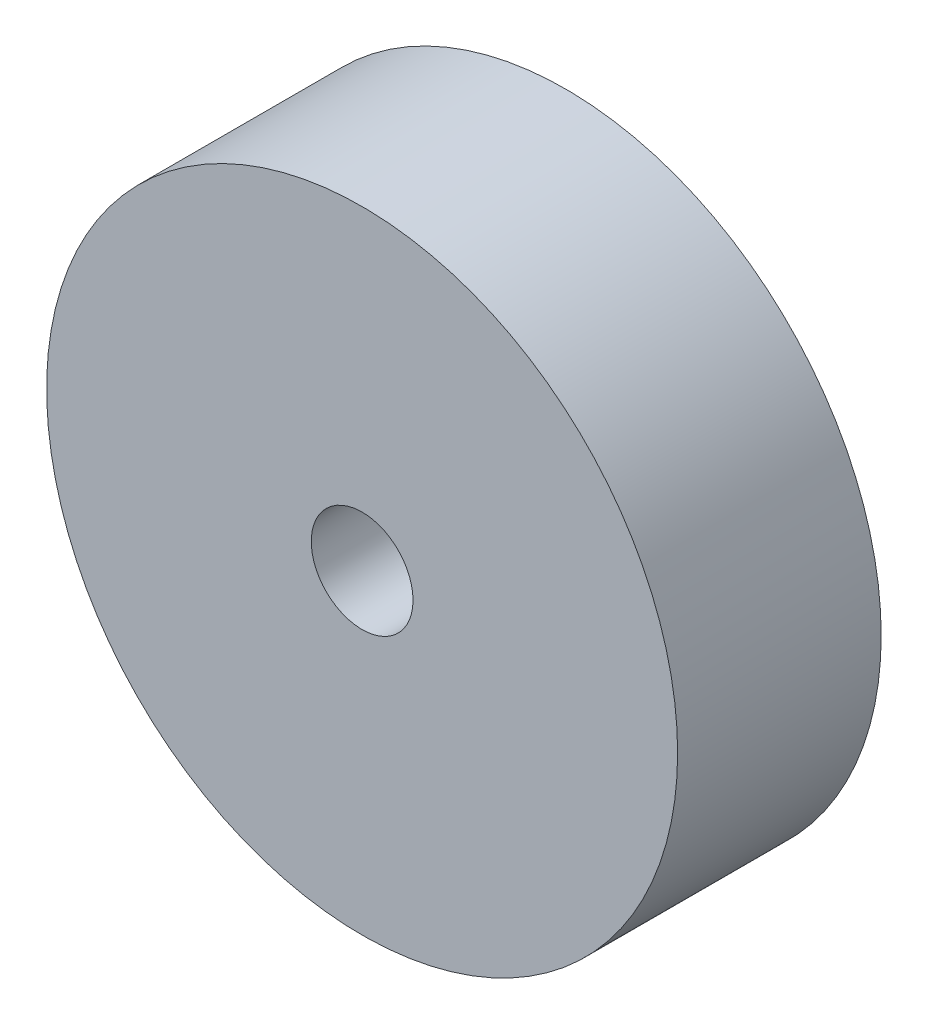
from build123d import *

# Parameters (mm, degrees)
SKETCH1_R                 = 6.2
BOSS_EXTRUDE1_DEPTH       = 2
HOLE_FOR_SHAFT_DEPTH      = 9.993330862
HOLE_FOR_SHAFT_DEPTH_BACK = 9.993330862
SKETCH3_R                 = 1


with BuildPart() as part:
    # Sketch1 → Boss-Extrude1 (new, symmetric)
    with BuildSketch(Plane.XY):
        Circle(SKETCH1_R)
    extrude(amount=BOSS_EXTRUDE1_DEPTH, both=True)

    # Sketch3 → hole for shaft (cut, two sides: drawn at the far end of the back side and taken through both)
    with BuildSketch(Plane.XY.offset(-HOLE_FOR_SHAFT_DEPTH_BACK)):
        Circle(SKETCH3_R)
    extrude(amount=HOLE_FOR_SHAFT_DEPTH + HOLE_FOR_SHAFT_DEPTH_BACK, mode=Mode.SUBTRACT)


solid = part.part
